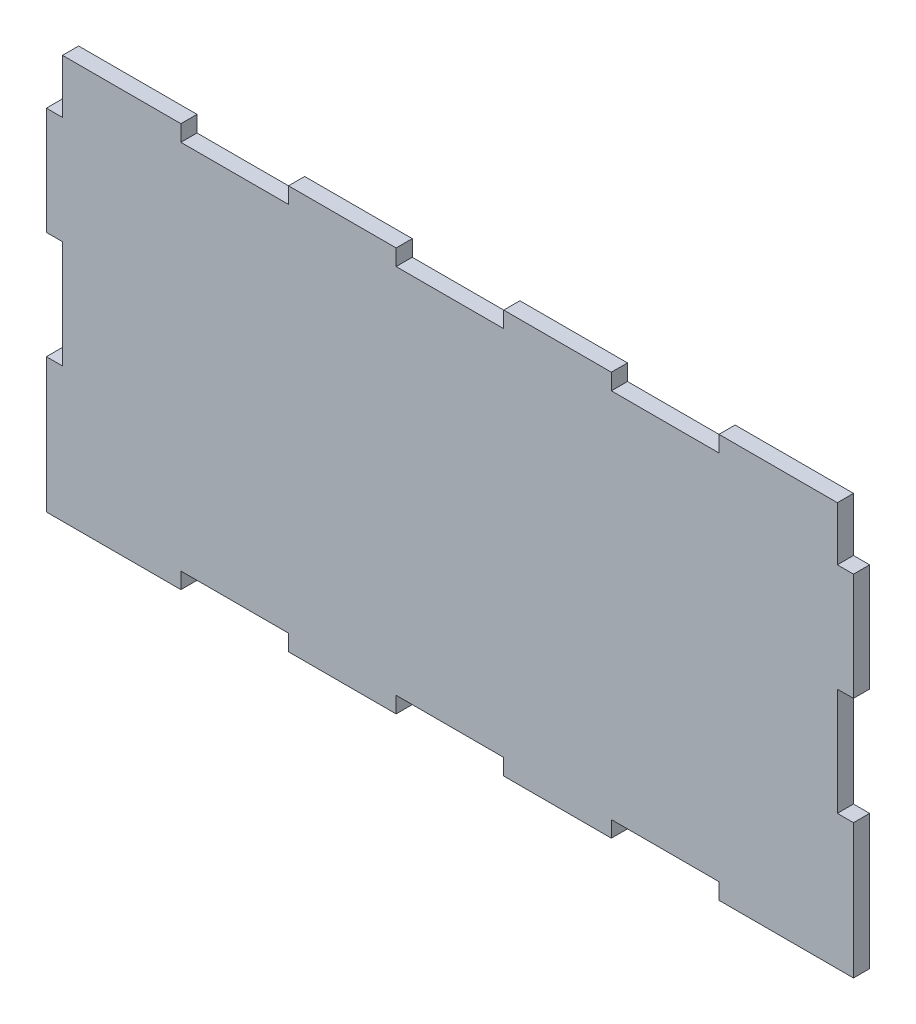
ISO-10303-21;
HEADER;
FILE_DESCRIPTION(('STEP AP214'),'2;1');
FILE_NAME('part.step','',(''),(''),'','','');
FILE_SCHEMA(('AUTOMOTIVE_DESIGN { 1 0 10303 214 1 1 1 1 }'));
ENDSEC;
DATA;
#1=APPLICATION_CONTEXT('core data for automotive mechanical design processes');
#2=APPLICATION_PROTOCOL_DEFINITION('international standard','automotive_design',2000,#1);
#3=PRODUCT_CONTEXT('',#1,'mechanical');
#4=PRODUCT('Part','Part','',(#3));
#5=PRODUCT_RELATED_PRODUCT_CATEGORY('part','',(#4));
#6=PRODUCT_DEFINITION_FORMATION('','',#4);
#7=PRODUCT_DEFINITION_CONTEXT('part definition',#1,'design');
#8=PRODUCT_DEFINITION('design','',#6,#7);
#9=PRODUCT_DEFINITION_SHAPE('','',#8);
#10=(LENGTH_UNIT() NAMED_UNIT(*) SI_UNIT(.MILLI.,.METRE.));
#11=(NAMED_UNIT(*) PLANE_ANGLE_UNIT() SI_UNIT($,.RADIAN.));
#12=(NAMED_UNIT(*) SI_UNIT($,.STERADIAN.) SOLID_ANGLE_UNIT());
#13=UNCERTAINTY_MEASURE_WITH_UNIT(LENGTH_MEASURE(1.E-05),#10,'distance_accuracy_value','');
#14=(GEOMETRIC_REPRESENTATION_CONTEXT(3) GLOBAL_UNCERTAINTY_ASSIGNED_CONTEXT((#13)) GLOBAL_UNIT_ASSIGNED_CONTEXT((#10,
#11,#12)) REPRESENTATION_CONTEXT('',''));
#15=CARTESIAN_POINT('',(0.,0.,0.));
#16=DIRECTION('',(0.,0.,1.));
#17=DIRECTION('',(1.,0.,0.));
#18=AXIS2_PLACEMENT_3D('',#15,#16,#17);
#19=CARTESIAN_POINT('',(0.,0.,12.));
#20=DIRECTION('',(1.,0.,0.));
#21=DIRECTION('',(0.,0.,-1.));
#22=AXIS2_PLACEMENT_3D('',#19,#20,#21);
#23=PLANE('',#22);
#24=DIRECTION('',(0.,-1.,0.));
#25=VECTOR('',#24,1.);
#26=CARTESIAN_POINT('',(0.,0.,0.));
#27=LINE('',#26,#25);
#28=CARTESIAN_POINT('',(0.,260.,0.));
#29=VERTEX_POINT('',#28);
#30=CARTESIAN_POINT('',(0.,180.,0.));
#31=VERTEX_POINT('',#30);
#32=EDGE_CURVE('E565',#29,#31,#27,.T.);
#33=ORIENTED_EDGE('',*,*,#32,.T.);
#34=DIRECTION('',(0.,0.,1.));
#35=VECTOR('',#34,1.);
#36=CARTESIAN_POINT('',(0.,180.,0.));
#37=LINE('',#36,#35);
#38=CARTESIAN_POINT('',(0.,180.,12.));
#39=VERTEX_POINT('',#38);
#40=EDGE_CURVE('E395',#31,#39,#37,.T.);
#41=ORIENTED_EDGE('',*,*,#40,.T.);
#42=DIRECTION('',(0.,-1.,0.));
#43=VECTOR('',#42,1.);
#44=CARTESIAN_POINT('',(0.,0.,12.));
#45=LINE('',#44,#43);
#46=CARTESIAN_POINT('',(0.,260.,12.));
#47=VERTEX_POINT('',#46);
#48=EDGE_CURVE('E550',#47,#39,#45,.T.);
#49=ORIENTED_EDGE('',*,*,#48,.F.);
#50=DIRECTION('',(0.,0.,1.));
#51=VECTOR('',#50,1.);
#52=CARTESIAN_POINT('',(0.,260.,0.));
#53=LINE('',#52,#51);
#54=EDGE_CURVE('E477',#29,#47,#53,.T.);
#55=ORIENTED_EDGE('',*,*,#54,.F.);
#56=EDGE_LOOP('',(#33,#41,#49,#55));
#57=FACE_BOUND('',#56,.T.);
#58=ADVANCED_FACE('F44',(#57),#23,.F.);
#59=CARTESIAN_POINT('',(0.,0.,12.));
#60=DIRECTION('',(0.,1.,0.));
#61=DIRECTION('',(0.,0.,1.));
#62=AXIS2_PLACEMENT_3D('',#59,#60,#61);
#63=PLANE('',#62);
#64=DIRECTION('',(1.,0.,0.));
#65=VECTOR('',#64,1.);
#66=CARTESIAN_POINT('',(0.,0.,0.));
#67=LINE('',#66,#65);
#68=CARTESIAN_POINT('',(340.,0.,0.));
#69=VERTEX_POINT('',#68);
#70=CARTESIAN_POINT('',(420.,0.,0.));
#71=VERTEX_POINT('',#70);
#72=EDGE_CURVE('E648',#69,#71,#67,.T.);
#73=ORIENTED_EDGE('',*,*,#72,.T.);
#74=DIRECTION('',(0.,0.,1.));
#75=VECTOR('',#74,1.);
#76=CARTESIAN_POINT('',(420.,0.,0.));
#77=LINE('',#76,#75);
#78=CARTESIAN_POINT('',(420.,0.,12.));
#79=VERTEX_POINT('',#78);
#80=EDGE_CURVE('E451',#71,#79,#77,.T.);
#81=ORIENTED_EDGE('',*,*,#80,.T.);
#82=DIRECTION('',(1.,0.,0.));
#83=VECTOR('',#82,1.);
#84=CARTESIAN_POINT('',(0.,0.,12.));
#85=LINE('',#84,#83);
#86=CARTESIAN_POINT('',(340.,0.,12.));
#87=VERTEX_POINT('',#86);
#88=EDGE_CURVE('E617',#87,#79,#85,.T.);
#89=ORIENTED_EDGE('',*,*,#88,.F.);
#90=DIRECTION('',(0.,0.,1.));
#91=VECTOR('',#90,1.);
#92=CARTESIAN_POINT('',(340.,0.,0.));
#93=LINE('',#92,#91);
#94=EDGE_CURVE('E427',#69,#87,#93,.T.);
#95=ORIENTED_EDGE('',*,*,#94,.F.);
#96=EDGE_LOOP('',(#73,#81,#89,#95));
#97=FACE_BOUND('',#96,.T.);
#98=ADVANCED_FACE('F647',(#97),#63,.F.);
#99=CARTESIAN_POINT('',(180.,0.,0.));
#100=VERTEX_POINT('',#99);
#101=CARTESIAN_POINT('',(260.,0.,0.));
#102=VERTEX_POINT('',#101);
#103=EDGE_CURVE('E570',#100,#102,#67,.T.);
#104=ORIENTED_EDGE('',*,*,#103,.T.);
#105=DIRECTION('',(0.,0.,1.));
#106=VECTOR('',#105,1.);
#107=CARTESIAN_POINT('',(260.,0.,0.));
#108=LINE('',#107,#106);
#109=CARTESIAN_POINT('',(260.,0.,12.));
#110=VERTEX_POINT('',#109);
#111=EDGE_CURVE('E423',#102,#110,#108,.T.);
#112=ORIENTED_EDGE('',*,*,#111,.T.);
#113=CARTESIAN_POINT('',(180.,0.,12.));
#114=VERTEX_POINT('',#113);
#115=EDGE_CURVE('E556',#114,#110,#85,.T.);
#116=ORIENTED_EDGE('',*,*,#115,.F.);
#117=DIRECTION('',(0.,0.,1.));
#118=VECTOR('',#117,1.);
#119=CARTESIAN_POINT('',(180.,0.,0.));
#120=LINE('',#119,#118);
#121=EDGE_CURVE('E538',#100,#114,#120,.T.);
#122=ORIENTED_EDGE('',*,*,#121,.F.);
#123=EDGE_LOOP('',(#104,#112,#116,#122));
#124=FACE_BOUND('',#123,.T.);
#125=ADVANCED_FACE('F633',(#124),#63,.F.);
#126=CARTESIAN_POINT('',(0.,0.,0.));
#127=VERTEX_POINT('',#126);
#128=CARTESIAN_POINT('',(100.,0.,0.));
#129=VERTEX_POINT('',#128);
#130=EDGE_CURVE('E566',#127,#129,#67,.T.);
#131=ORIENTED_EDGE('',*,*,#130,.T.);
#132=DIRECTION('',(0.,0.,1.));
#133=VECTOR('',#132,1.);
#134=CARTESIAN_POINT('',(100.,0.,0.));
#135=LINE('',#134,#133);
#136=CARTESIAN_POINT('',(100.,0.,12.));
#137=VERTEX_POINT('',#136);
#138=EDGE_CURVE('E526',#129,#137,#135,.T.);
#139=ORIENTED_EDGE('',*,*,#138,.T.);
#140=CARTESIAN_POINT('',(0.,0.,12.));
#141=VERTEX_POINT('',#140);
#142=EDGE_CURVE('E552',#141,#137,#85,.T.);
#143=ORIENTED_EDGE('',*,*,#142,.F.);
#144=DIRECTION('',(0.,0.,-1.));
#145=VECTOR('',#144,1.);
#146=CARTESIAN_POINT('',(0.,0.,12.));
#147=LINE('',#146,#145);
#148=EDGE_CURVE('E52',#141,#127,#147,.T.);
#149=ORIENTED_EDGE('',*,*,#148,.T.);
#150=EDGE_LOOP('',(#131,#139,#143,#149));
#151=FACE_BOUND('',#150,.T.);
#152=ADVANCED_FACE('F585',(#151),#63,.F.);
#153=CARTESIAN_POINT('',(600.,0.,12.));
#154=DIRECTION('',(-1.,0.,0.));
#155=DIRECTION('',(0.,0.,1.));
#156=AXIS2_PLACEMENT_3D('',#153,#154,#155);
#157=PLANE('',#156);
#158=DIRECTION('',(0.,1.,0.));
#159=VECTOR('',#158,1.);
#160=CARTESIAN_POINT('',(600.,0.,0.));
#161=LINE('',#160,#159);
#162=CARTESIAN_POINT('',(600.,0.,0.));
#163=VERTEX_POINT('',#162);
#164=CARTESIAN_POINT('',(600.,100.,0.));
#165=VERTEX_POINT('',#164);
#166=EDGE_CURVE('E572',#163,#165,#161,.T.);
#167=ORIENTED_EDGE('',*,*,#166,.T.);
#168=DIRECTION('',(0.,0.,1.));
#169=VECTOR('',#168,1.);
#170=CARTESIAN_POINT('',(600.,100.,0.));
#171=LINE('',#170,#169);
#172=CARTESIAN_POINT('',(600.,100.,12.));
#173=VERTEX_POINT('',#172);
#174=EDGE_CURVE('E335',#165,#173,#171,.T.);
#175=ORIENTED_EDGE('',*,*,#174,.T.);
#176=DIRECTION('',(0.,1.,0.));
#177=VECTOR('',#176,1.);
#178=CARTESIAN_POINT('',(600.,0.,12.));
#179=LINE('',#178,#177);
#180=CARTESIAN_POINT('',(600.,0.,12.));
#181=VERTEX_POINT('',#180);
#182=EDGE_CURVE('E324',#181,#173,#179,.T.);
#183=ORIENTED_EDGE('',*,*,#182,.F.);
#184=DIRECTION('',(0.,0.,-1.));
#185=VECTOR('',#184,1.);
#186=CARTESIAN_POINT('',(600.,0.,12.));
#187=LINE('',#186,#185);
#188=EDGE_CURVE('E579',#181,#163,#187,.T.);
#189=ORIENTED_EDGE('',*,*,#188,.T.);
#190=EDGE_LOOP('',(#167,#175,#183,#189));
#191=FACE_BOUND('',#190,.T.);
#192=ADVANCED_FACE('F664',(#191),#157,.F.);
#193=CARTESIAN_POINT('',(0.,300.,12.));
#194=DIRECTION('',(0.,-1.,0.));
#195=DIRECTION('',(0.,0.,-1.));
#196=AXIS2_PLACEMENT_3D('',#193,#194,#195);
#197=PLANE('',#196);
#198=DIRECTION('',(-1.,0.,0.));
#199=VECTOR('',#198,1.);
#200=CARTESIAN_POINT('',(0.,300.,0.));
#201=LINE('',#200,#199);
#202=CARTESIAN_POINT('',(588.,300.,0.));
#203=VERTEX_POINT('',#202);
#204=CARTESIAN_POINT('',(500.,300.,0.));
#205=VERTEX_POINT('',#204);
#206=EDGE_CURVE('E551',#203,#205,#201,.T.);
#207=ORIENTED_EDGE('',*,*,#206,.T.);
#208=DIRECTION('',(0.,0.,1.));
#209=VECTOR('',#208,1.);
#210=CARTESIAN_POINT('',(500.,300.,0.));
#211=LINE('',#210,#209);
#212=CARTESIAN_POINT('',(500.,300.,12.));
#213=VERTEX_POINT('',#212);
#214=EDGE_CURVE('E382',#205,#213,#211,.T.);
#215=ORIENTED_EDGE('',*,*,#214,.T.);
#216=DIRECTION('',(-1.,0.,0.));
#217=VECTOR('',#216,1.);
#218=CARTESIAN_POINT('',(0.,300.,12.));
#219=LINE('',#218,#217);
#220=CARTESIAN_POINT('',(588.,300.,12.));
#221=VERTEX_POINT('',#220);
#222=EDGE_CURVE('E563',#221,#213,#219,.T.);
#223=ORIENTED_EDGE('',*,*,#222,.F.);
#224=DIRECTION('',(0.,0.,-1.));
#225=VECTOR('',#224,1.);
#226=CARTESIAN_POINT('',(588.,300.,12.));
#227=LINE('',#226,#225);
#228=EDGE_CURVE('E544',#221,#203,#227,.T.);
#229=ORIENTED_EDGE('',*,*,#228,.T.);
#230=EDGE_LOOP('',(#207,#215,#223,#229));
#231=FACE_BOUND('',#230,.T.);
#232=ADVANCED_FACE('F690',(#231),#197,.F.);
#233=CARTESIAN_POINT('',(420.,300.,12.));
#234=VERTEX_POINT('',#233);
#235=CARTESIAN_POINT('',(340.,300.,12.));
#236=VERTEX_POINT('',#235);
#237=EDGE_CURVE('E692',#234,#236,#219,.T.);
#238=ORIENTED_EDGE('',*,*,#237,.F.);
#239=DIRECTION('',(0.,0.,1.));
#240=VECTOR('',#239,1.);
#241=CARTESIAN_POINT('',(420.,300.,0.));
#242=LINE('',#241,#240);
#243=CARTESIAN_POINT('',(420.,300.,0.));
#244=VERTEX_POINT('',#243);
#245=EDGE_CURVE('E375',#244,#234,#242,.T.);
#246=ORIENTED_EDGE('',*,*,#245,.F.);
#247=CARTESIAN_POINT('',(340.,300.,0.));
#248=VERTEX_POINT('',#247);
#249=EDGE_CURVE('E1158',#244,#248,#201,.T.);
#250=ORIENTED_EDGE('',*,*,#249,.T.);
#251=DIRECTION('',(0.,0.,1.));
#252=VECTOR('',#251,1.);
#253=CARTESIAN_POINT('',(340.,300.,0.));
#254=LINE('',#253,#252);
#255=EDGE_CURVE('E359',#248,#236,#254,.T.);
#256=ORIENTED_EDGE('',*,*,#255,.T.);
#257=EDGE_LOOP('',(#238,#246,#250,#256));
#258=FACE_BOUND('',#257,.T.);
#259=ADVANCED_FACE('F745',(#258),#197,.F.);
#260=CARTESIAN_POINT('',(260.,300.,12.));
#261=VERTEX_POINT('',#260);
#262=CARTESIAN_POINT('',(180.,300.,12.));
#263=VERTEX_POINT('',#262);
#264=EDGE_CURVE('E562',#261,#263,#219,.T.);
#265=ORIENTED_EDGE('',*,*,#264,.F.);
#266=DIRECTION('',(0.,0.,1.));
#267=VECTOR('',#266,1.);
#268=CARTESIAN_POINT('',(260.,300.,0.));
#269=LINE('',#268,#267);
#270=CARTESIAN_POINT('',(260.,300.,0.));
#271=VERTEX_POINT('',#270);
#272=EDGE_CURVE('E401',#271,#261,#269,.T.);
#273=ORIENTED_EDGE('',*,*,#272,.F.);
#274=CARTESIAN_POINT('',(180.,300.,0.));
#275=VERTEX_POINT('',#274);
#276=EDGE_CURVE('E578',#271,#275,#201,.T.);
#277=ORIENTED_EDGE('',*,*,#276,.T.);
#278=DIRECTION('',(0.,0.,1.));
#279=VECTOR('',#278,1.);
#280=CARTESIAN_POINT('',(180.,300.,0.));
#281=LINE('',#280,#279);
#282=EDGE_CURVE('E346',#275,#263,#281,.T.);
#283=ORIENTED_EDGE('',*,*,#282,.T.);
#284=EDGE_LOOP('',(#265,#273,#277,#283));
#285=FACE_BOUND('',#284,.T.);
#286=ADVANCED_FACE('F705',(#285),#197,.F.);
#287=CARTESIAN_POINT('',(0.,100.,12.));
#288=VERTEX_POINT('',#287);
#289=EDGE_CURVE('E548',#288,#141,#45,.T.);
#290=ORIENTED_EDGE('',*,*,#289,.F.);
#291=DIRECTION('',(0.,0.,1.));
#292=VECTOR('',#291,1.);
#293=CARTESIAN_POINT('',(0.,100.,0.));
#294=LINE('',#293,#292);
#295=CARTESIAN_POINT('',(0.,100.,0.));
#296=VERTEX_POINT('',#295);
#297=EDGE_CURVE('E492',#296,#288,#294,.T.);
#298=ORIENTED_EDGE('',*,*,#297,.F.);
#299=EDGE_CURVE('E547',#296,#127,#27,.T.);
#300=ORIENTED_EDGE('',*,*,#299,.T.);
#301=ORIENTED_EDGE('',*,*,#148,.F.);
#302=EDGE_LOOP('',(#290,#298,#300,#301));
#303=FACE_BOUND('',#302,.T.);
#304=ADVANCED_FACE('F46',(#303),#23,.F.);
#305=CARTESIAN_POINT('',(500.,0.,12.));
#306=VERTEX_POINT('',#305);
#307=EDGE_CURVE('E557',#306,#181,#85,.T.);
#308=ORIENTED_EDGE('',*,*,#307,.F.);
#309=DIRECTION('',(0.,0.,1.));
#310=VECTOR('',#309,1.);
#311=CARTESIAN_POINT('',(500.,0.,0.));
#312=LINE('',#311,#310);
#313=CARTESIAN_POINT('',(500.,0.,0.));
#314=VERTEX_POINT('',#313);
#315=EDGE_CURVE('E455',#314,#306,#312,.T.);
#316=ORIENTED_EDGE('',*,*,#315,.F.);
#317=EDGE_CURVE('E571',#314,#163,#67,.T.);
#318=ORIENTED_EDGE('',*,*,#317,.T.);
#319=ORIENTED_EDGE('',*,*,#188,.F.);
#320=EDGE_LOOP('',(#308,#316,#318,#319));
#321=FACE_BOUND('',#320,.T.);
#322=ADVANCED_FACE('F661',(#321),#63,.F.);
#323=CARTESIAN_POINT('',(600.,180.,0.));
#324=VERTEX_POINT('',#323);
#325=CARTESIAN_POINT('',(600.,260.,0.));
#326=VERTEX_POINT('',#325);
#327=EDGE_CURVE('E569',#324,#326,#161,.T.);
#328=ORIENTED_EDGE('',*,*,#327,.T.);
#329=DIRECTION('',(0.,0.,1.));
#330=VECTOR('',#329,1.);
#331=CARTESIAN_POINT('',(600.,260.,0.));
#332=LINE('',#331,#330);
#333=CARTESIAN_POINT('',(600.,260.,12.));
#334=VERTEX_POINT('',#333);
#335=EDGE_CURVE('E328',#326,#334,#332,.T.);
#336=ORIENTED_EDGE('',*,*,#335,.T.);
#337=CARTESIAN_POINT('',(600.,180.,12.));
#338=VERTEX_POINT('',#337);
#339=EDGE_CURVE('E555',#338,#334,#179,.T.);
#340=ORIENTED_EDGE('',*,*,#339,.F.);
#341=DIRECTION('',(0.,0.,1.));
#342=VECTOR('',#341,1.);
#343=CARTESIAN_POINT('',(600.,180.,0.));
#344=LINE('',#343,#342);
#345=EDGE_CURVE('E665',#324,#338,#344,.T.);
#346=ORIENTED_EDGE('',*,*,#345,.F.);
#347=EDGE_LOOP('',(#328,#336,#340,#346));
#348=FACE_BOUND('',#347,.T.);
#349=ADVANCED_FACE('F678',(#348),#157,.F.);
#350=CARTESIAN_POINT('',(100.,300.,12.));
#351=VERTEX_POINT('',#350);
#352=CARTESIAN_POINT('',(12.,300.,12.));
#353=VERTEX_POINT('',#352);
#354=EDGE_CURVE('E559',#351,#353,#219,.T.);
#355=ORIENTED_EDGE('',*,*,#354,.F.);
#356=DIRECTION('',(0.,0.,1.));
#357=VECTOR('',#356,1.);
#358=CARTESIAN_POINT('',(100.,300.,0.));
#359=LINE('',#358,#357);
#360=CARTESIAN_POINT('',(100.,300.,0.));
#361=VERTEX_POINT('',#360);
#362=EDGE_CURVE('E339',#361,#351,#359,.T.);
#363=ORIENTED_EDGE('',*,*,#362,.F.);
#364=CARTESIAN_POINT('',(12.,300.,0.));
#365=VERTEX_POINT('',#364);
#366=EDGE_CURVE('E575',#361,#365,#201,.T.);
#367=ORIENTED_EDGE('',*,*,#366,.T.);
#368=DIRECTION('',(0.,0.,1.));
#369=VECTOR('',#368,1.);
#370=CARTESIAN_POINT('',(12.,300.,12.));
#371=LINE('',#370,#369);
#372=EDGE_CURVE('E535',#365,#353,#371,.T.);
#373=ORIENTED_EDGE('',*,*,#372,.T.);
#374=EDGE_LOOP('',(#355,#363,#367,#373));
#375=FACE_BOUND('',#374,.T.);
#376=ADVANCED_FACE('F721',(#375),#197,.F.);
#377=CARTESIAN_POINT('',(0.,0.,12.));
#378=DIRECTION('',(0.,0.,-1.));
#379=DIRECTION('',(-1.,0.,0.));
#380=AXIS2_PLACEMENT_3D('',#377,#378,#379);
#381=PLANE('',#380);
#382=ORIENTED_EDGE('',*,*,#222,.T.);
#383=DIRECTION('',(0.,1.,0.));
#384=VECTOR('',#383,1.);
#385=CARTESIAN_POINT('',(500.,300.,12.));
#386=LINE('',#385,#384);
#387=CARTESIAN_POINT('',(500.,288.,12.));
#388=VERTEX_POINT('',#387);
#389=EDGE_CURVE('E386',#388,#213,#386,.T.);
#390=ORIENTED_EDGE('',*,*,#389,.F.);
#391=DIRECTION('',(1.,0.,0.));
#392=VECTOR('',#391,1.);
#393=CARTESIAN_POINT('',(420.,288.,12.));
#394=LINE('',#393,#392);
#395=CARTESIAN_POINT('',(420.,288.,12.));
#396=VERTEX_POINT('',#395);
#397=EDGE_CURVE('E388',#396,#388,#394,.T.);
#398=ORIENTED_EDGE('',*,*,#397,.F.);
#399=DIRECTION('',(0.,-1.,0.));
#400=VECTOR('',#399,1.);
#401=CARTESIAN_POINT('',(420.,300.,12.));
#402=LINE('',#401,#400);
#403=EDGE_CURVE('E392',#234,#396,#402,.T.);
#404=ORIENTED_EDGE('',*,*,#403,.F.);
#405=ORIENTED_EDGE('',*,*,#237,.T.);
#406=DIRECTION('',(0.,1.,0.));
#407=VECTOR('',#406,1.);
#408=CARTESIAN_POINT('',(340.,300.,12.));
#409=LINE('',#408,#407);
#410=CARTESIAN_POINT('',(340.,288.,12.));
#411=VERTEX_POINT('',#410);
#412=EDGE_CURVE('E410',#411,#236,#409,.T.);
#413=ORIENTED_EDGE('',*,*,#412,.F.);
#414=DIRECTION('',(1.,0.,0.));
#415=VECTOR('',#414,1.);
#416=CARTESIAN_POINT('',(260.,288.,12.));
#417=LINE('',#416,#415);
#418=CARTESIAN_POINT('',(260.,288.,12.));
#419=VERTEX_POINT('',#418);
#420=EDGE_CURVE('E412',#419,#411,#417,.T.);
#421=ORIENTED_EDGE('',*,*,#420,.F.);
#422=DIRECTION('',(0.,-1.,0.));
#423=VECTOR('',#422,1.);
#424=CARTESIAN_POINT('',(260.,300.,12.));
#425=LINE('',#424,#423);
#426=EDGE_CURVE('E385',#261,#419,#425,.T.);
#427=ORIENTED_EDGE('',*,*,#426,.F.);
#428=ORIENTED_EDGE('',*,*,#264,.T.);
#429=DIRECTION('',(0.,1.,0.));
#430=VECTOR('',#429,1.);
#431=CARTESIAN_POINT('',(180.,300.,12.));
#432=LINE('',#431,#430);
#433=CARTESIAN_POINT('',(180.,288.,12.));
#434=VERTEX_POINT('',#433);
#435=EDGE_CURVE('E350',#434,#263,#432,.T.);
#436=ORIENTED_EDGE('',*,*,#435,.F.);
#437=DIRECTION('',(1.,0.,0.));
#438=VECTOR('',#437,1.);
#439=CARTESIAN_POINT('',(100.,288.,12.));
#440=LINE('',#439,#438);
#441=CARTESIAN_POINT('',(100.,288.,12.));
#442=VERTEX_POINT('',#441);
#443=EDGE_CURVE('E352',#442,#434,#440,.T.);
#444=ORIENTED_EDGE('',*,*,#443,.F.);
#445=DIRECTION('',(0.,-1.,0.));
#446=VECTOR('',#445,1.);
#447=CARTESIAN_POINT('',(100.,300.,12.));
#448=LINE('',#447,#446);
#449=EDGE_CURVE('E356',#351,#442,#448,.T.);
#450=ORIENTED_EDGE('',*,*,#449,.F.);
#451=ORIENTED_EDGE('',*,*,#354,.T.);
#452=DIRECTION('',(0.,1.,0.));
#453=VECTOR('',#452,1.);
#454=CARTESIAN_POINT('',(12.,260.,12.));
#455=LINE('',#454,#453);
#456=CARTESIAN_POINT('',(12.,260.,12.));
#457=VERTEX_POINT('',#456);
#458=EDGE_CURVE('E483',#457,#353,#455,.T.);
#459=ORIENTED_EDGE('',*,*,#458,.F.);
#460=DIRECTION('',(1.,0.,0.));
#461=VECTOR('',#460,1.);
#462=CARTESIAN_POINT('',(0.,260.,12.));
#463=LINE('',#462,#461);
#464=EDGE_CURVE('E461',#47,#457,#463,.T.);
#465=ORIENTED_EDGE('',*,*,#464,.F.);
#466=ORIENTED_EDGE('',*,*,#48,.T.);
#467=DIRECTION('',(-1.,0.,0.));
#468=VECTOR('',#467,1.);
#469=CARTESIAN_POINT('',(0.,180.,12.));
#470=LINE('',#469,#468);
#471=CARTESIAN_POINT('',(12.,180.,12.));
#472=VERTEX_POINT('',#471);
#473=EDGE_CURVE('E501',#472,#39,#470,.T.);
#474=ORIENTED_EDGE('',*,*,#473,.F.);
#475=DIRECTION('',(0.,1.,0.));
#476=VECTOR('',#475,1.);
#477=CARTESIAN_POINT('',(12.,100.,12.));
#478=LINE('',#477,#476);
#479=CARTESIAN_POINT('',(12.,100.,12.));
#480=VERTEX_POINT('',#479);
#481=EDGE_CURVE('E503',#480,#472,#478,.T.);
#482=ORIENTED_EDGE('',*,*,#481,.F.);
#483=DIRECTION('',(1.,0.,0.));
#484=VECTOR('',#483,1.);
#485=CARTESIAN_POINT('',(0.,100.,12.));
#486=LINE('',#485,#484);
#487=EDGE_CURVE('E482',#288,#480,#486,.T.);
#488=ORIENTED_EDGE('',*,*,#487,.F.);
#489=ORIENTED_EDGE('',*,*,#289,.T.);
#490=ORIENTED_EDGE('',*,*,#142,.T.);
#491=DIRECTION('',(0.,-1.,0.));
#492=VECTOR('',#491,1.);
#493=CARTESIAN_POINT('',(100.,0.,12.));
#494=LINE('',#493,#492);
#495=CARTESIAN_POINT('',(100.,12.,12.));
#496=VERTEX_POINT('',#495);
#497=EDGE_CURVE('E443',#496,#137,#494,.T.);
#498=ORIENTED_EDGE('',*,*,#497,.F.);
#499=DIRECTION('',(-1.,0.,0.));
#500=VECTOR('',#499,1.);
#501=CARTESIAN_POINT('',(100.,12.,12.));
#502=LINE('',#501,#500);
#503=CARTESIAN_POINT('',(180.,12.,12.));
#504=VERTEX_POINT('',#503);
#505=EDGE_CURVE('E520',#504,#496,#502,.T.);
#506=ORIENTED_EDGE('',*,*,#505,.F.);
#507=DIRECTION('',(0.,1.,0.));
#508=VECTOR('',#507,1.);
#509=CARTESIAN_POINT('',(180.,0.,12.));
#510=LINE('',#509,#508);
#511=EDGE_CURVE('E528',#114,#504,#510,.T.);
#512=ORIENTED_EDGE('',*,*,#511,.F.);
#513=ORIENTED_EDGE('',*,*,#115,.T.);
#514=DIRECTION('',(0.,-1.,0.));
#515=VECTOR('',#514,1.);
#516=CARTESIAN_POINT('',(260.,0.,12.));
#517=LINE('',#516,#515);
#518=CARTESIAN_POINT('',(260.,12.,12.));
#519=VERTEX_POINT('',#518);
#520=EDGE_CURVE('E441',#519,#110,#517,.T.);
#521=ORIENTED_EDGE('',*,*,#520,.F.);
#522=DIRECTION('',(-1.,0.,0.));
#523=VECTOR('',#522,1.);
#524=CARTESIAN_POINT('',(260.,12.,12.));
#525=LINE('',#524,#523);
#526=CARTESIAN_POINT('',(340.,12.,12.));
#527=VERTEX_POINT('',#526);
#528=EDGE_CURVE('E434',#527,#519,#525,.T.);
#529=ORIENTED_EDGE('',*,*,#528,.F.);
#530=DIRECTION('',(0.,1.,0.));
#531=VECTOR('',#530,1.);
#532=CARTESIAN_POINT('',(340.,0.,12.));
#533=LINE('',#532,#531);
#534=EDGE_CURVE('E437',#87,#527,#533,.T.);
#535=ORIENTED_EDGE('',*,*,#534,.F.);
#536=ORIENTED_EDGE('',*,*,#88,.T.);
#537=DIRECTION('',(0.,-1.,0.));
#538=VECTOR('',#537,1.);
#539=CARTESIAN_POINT('',(420.,0.,12.));
#540=LINE('',#539,#538);
#541=CARTESIAN_POINT('',(420.,12.,12.));
#542=VERTEX_POINT('',#541);
#543=EDGE_CURVE('E433',#542,#79,#540,.T.);
#544=ORIENTED_EDGE('',*,*,#543,.F.);
#545=DIRECTION('',(-1.,0.,0.));
#546=VECTOR('',#545,1.);
#547=CARTESIAN_POINT('',(420.,12.,12.));
#548=LINE('',#547,#546);
#549=CARTESIAN_POINT('',(500.,12.,12.));
#550=VERTEX_POINT('',#549);
#551=EDGE_CURVE('E462',#550,#542,#548,.T.);
#552=ORIENTED_EDGE('',*,*,#551,.F.);
#553=DIRECTION('',(0.,1.,0.));
#554=VECTOR('',#553,1.);
#555=CARTESIAN_POINT('',(500.,0.,12.));
#556=LINE('',#555,#554);
#557=EDGE_CURVE('E465',#306,#550,#556,.T.);
#558=ORIENTED_EDGE('',*,*,#557,.F.);
#559=ORIENTED_EDGE('',*,*,#307,.T.);
#560=ORIENTED_EDGE('',*,*,#182,.T.);
#561=DIRECTION('',(1.,0.,0.));
#562=VECTOR('',#561,1.);
#563=CARTESIAN_POINT('',(600.,100.,12.));
#564=LINE('',#563,#562);
#565=CARTESIAN_POINT('',(588.,100.,12.));
#566=VERTEX_POINT('',#565);
#567=EDGE_CURVE('E303',#566,#173,#564,.T.);
#568=ORIENTED_EDGE('',*,*,#567,.F.);
#569=DIRECTION('',(0.,-1.,0.));
#570=VECTOR('',#569,1.);
#571=CARTESIAN_POINT('',(588.,100.,12.));
#572=LINE('',#571,#570);
#573=CARTESIAN_POINT('',(588.,180.,12.));
#574=VERTEX_POINT('',#573);
#575=EDGE_CURVE('E312',#574,#566,#572,.T.);
#576=ORIENTED_EDGE('',*,*,#575,.F.);
#577=DIRECTION('',(-1.,0.,0.));
#578=VECTOR('',#577,1.);
#579=CARTESIAN_POINT('',(600.,180.,12.));
#580=LINE('',#579,#578);
#581=EDGE_CURVE('E318',#338,#574,#580,.T.);
#582=ORIENTED_EDGE('',*,*,#581,.F.);
#583=ORIENTED_EDGE('',*,*,#339,.T.);
#584=DIRECTION('',(1.,0.,0.));
#585=VECTOR('',#584,1.);
#586=CARTESIAN_POINT('',(600.,260.,12.));
#587=LINE('',#586,#585);
#588=CARTESIAN_POINT('',(588.,260.,12.));
#589=VERTEX_POINT('',#588);
#590=EDGE_CURVE('E349',#589,#334,#587,.T.);
#591=ORIENTED_EDGE('',*,*,#590,.F.);
#592=DIRECTION('',(0.,-1.,0.));
#593=VECTOR('',#592,1.);
#594=CARTESIAN_POINT('',(588.,260.,12.));
#595=LINE('',#594,#593);
#596=EDGE_CURVE('E370',#221,#589,#595,.T.);
#597=ORIENTED_EDGE('',*,*,#596,.F.);
#598=EDGE_LOOP('',(#382,#390,#398,#404,#405,#413,#421,#427,#428,#436,#444,#450,#451,#459,#465,
#466,#474,#482,#488,#489,#490,#498,#506,#512,#513,#521,#529,#535,#536,#544,#552,#558,#559,#560,
#568,#576,#582,#583,#591,#597));
#599=FACE_BOUND('',#598,.T.);
#600=ADVANCED_FACE('F322',(#599),#381,.F.);
#601=CARTESIAN_POINT('',(0.,0.,0.));
#602=DIRECTION('',(0.,0.,-1.));
#603=DIRECTION('',(-1.,0.,0.));
#604=AXIS2_PLACEMENT_3D('',#601,#602,#603);
#605=PLANE('',#604);
#606=DIRECTION('',(0.,1.,0.));
#607=VECTOR('',#606,1.);
#608=CARTESIAN_POINT('',(500.,300.,0.));
#609=LINE('',#608,#607);
#610=CARTESIAN_POINT('',(500.,288.,0.));
#611=VERTEX_POINT('',#610);
#612=EDGE_CURVE('E377',#611,#205,#609,.T.);
#613=ORIENTED_EDGE('',*,*,#612,.T.);
#614=ORIENTED_EDGE('',*,*,#206,.F.);
#615=DIRECTION('',(0.,1.,0.));
#616=VECTOR('',#615,1.);
#617=CARTESIAN_POINT('',(588.,0.,0.));
#618=LINE('',#617,#616);
#619=CARTESIAN_POINT('',(588.,260.,0.));
#620=VERTEX_POINT('',#619);
#621=EDGE_CURVE('E12',#620,#203,#618,.T.);
#622=ORIENTED_EDGE('',*,*,#621,.F.);
#623=DIRECTION('',(1.,0.,0.));
#624=VECTOR('',#623,1.);
#625=CARTESIAN_POINT('',(600.,260.,0.));
#626=LINE('',#625,#624);
#627=EDGE_CURVE('E368',#620,#326,#626,.T.);
#628=ORIENTED_EDGE('',*,*,#627,.T.);
#629=ORIENTED_EDGE('',*,*,#327,.F.);
#630=DIRECTION('',(-1.,0.,0.));
#631=VECTOR('',#630,1.);
#632=CARTESIAN_POINT('',(600.,180.,0.));
#633=LINE('',#632,#631);
#634=CARTESIAN_POINT('',(588.,180.,0.));
#635=VERTEX_POINT('',#634);
#636=EDGE_CURVE('E334',#324,#635,#633,.T.);
#637=ORIENTED_EDGE('',*,*,#636,.T.);
#638=DIRECTION('',(0.,-1.,0.));
#639=VECTOR('',#638,1.);
#640=CARTESIAN_POINT('',(588.,100.,0.));
#641=LINE('',#640,#639);
#642=CARTESIAN_POINT('',(588.,100.,0.));
#643=VERTEX_POINT('',#642);
#644=EDGE_CURVE('E332',#635,#643,#641,.T.);
#645=ORIENTED_EDGE('',*,*,#644,.T.);
#646=DIRECTION('',(1.,0.,0.));
#647=VECTOR('',#646,1.);
#648=CARTESIAN_POINT('',(600.,100.,0.));
#649=LINE('',#648,#647);
#650=EDGE_CURVE('E306',#643,#165,#649,.T.);
#651=ORIENTED_EDGE('',*,*,#650,.T.);
#652=ORIENTED_EDGE('',*,*,#166,.F.);
#653=ORIENTED_EDGE('',*,*,#317,.F.);
#654=DIRECTION('',(0.,1.,0.));
#655=VECTOR('',#654,1.);
#656=CARTESIAN_POINT('',(500.,0.,0.));
#657=LINE('',#656,#655);
#658=CARTESIAN_POINT('',(500.,12.,0.));
#659=VERTEX_POINT('',#658);
#660=EDGE_CURVE('E472',#314,#659,#657,.T.);
#661=ORIENTED_EDGE('',*,*,#660,.T.);
#662=DIRECTION('',(-1.,0.,0.));
#663=VECTOR('',#662,1.);
#664=CARTESIAN_POINT('',(420.,12.,0.));
#665=LINE('',#664,#663);
#666=CARTESIAN_POINT('',(420.,12.,0.));
#667=VERTEX_POINT('',#666);
#668=EDGE_CURVE('E454',#659,#667,#665,.T.);
#669=ORIENTED_EDGE('',*,*,#668,.T.);
#670=DIRECTION('',(0.,-1.,0.));
#671=VECTOR('',#670,1.);
#672=CARTESIAN_POINT('',(420.,0.,0.));
#673=LINE('',#672,#671);
#674=EDGE_CURVE('E466',#667,#71,#673,.T.);
#675=ORIENTED_EDGE('',*,*,#674,.T.);
#676=ORIENTED_EDGE('',*,*,#72,.F.);
#677=DIRECTION('',(0.,1.,0.));
#678=VECTOR('',#677,1.);
#679=CARTESIAN_POINT('',(340.,0.,0.));
#680=LINE('',#679,#678);
#681=CARTESIAN_POINT('',(340.,12.,0.));
#682=VERTEX_POINT('',#681);
#683=EDGE_CURVE('E446',#69,#682,#680,.T.);
#684=ORIENTED_EDGE('',*,*,#683,.T.);
#685=DIRECTION('',(-1.,0.,0.));
#686=VECTOR('',#685,1.);
#687=CARTESIAN_POINT('',(260.,12.,0.));
#688=LINE('',#687,#686);
#689=CARTESIAN_POINT('',(260.,12.,0.));
#690=VERTEX_POINT('',#689);
#691=EDGE_CURVE('E426',#682,#690,#688,.T.);
#692=ORIENTED_EDGE('',*,*,#691,.T.);
#693=DIRECTION('',(0.,-1.,0.));
#694=VECTOR('',#693,1.);
#695=CARTESIAN_POINT('',(260.,0.,0.));
#696=LINE('',#695,#694);
#697=EDGE_CURVE('E438',#690,#102,#696,.T.);
#698=ORIENTED_EDGE('',*,*,#697,.T.);
#699=ORIENTED_EDGE('',*,*,#103,.F.);
#700=DIRECTION('',(0.,1.,0.));
#701=VECTOR('',#700,1.);
#702=CARTESIAN_POINT('',(180.,0.,0.));
#703=LINE('',#702,#701);
#704=CARTESIAN_POINT('',(180.,12.,0.));
#705=VERTEX_POINT('',#704);
#706=EDGE_CURVE('E519',#100,#705,#703,.T.);
#707=ORIENTED_EDGE('',*,*,#706,.T.);
#708=DIRECTION('',(-1.,0.,0.));
#709=VECTOR('',#708,1.);
#710=CARTESIAN_POINT('',(100.,12.,0.));
#711=LINE('',#710,#709);
#712=CARTESIAN_POINT('',(100.,12.,0.));
#713=VERTEX_POINT('',#712);
#714=EDGE_CURVE('E523',#705,#713,#711,.T.);
#715=ORIENTED_EDGE('',*,*,#714,.T.);
#716=DIRECTION('',(0.,-1.,0.));
#717=VECTOR('',#716,1.);
#718=CARTESIAN_POINT('',(100.,0.,0.));
#719=LINE('',#718,#717);
#720=EDGE_CURVE('E516',#713,#129,#719,.T.);
#721=ORIENTED_EDGE('',*,*,#720,.T.);
#722=ORIENTED_EDGE('',*,*,#130,.F.);
#723=ORIENTED_EDGE('',*,*,#299,.F.);
#724=DIRECTION('',(1.,0.,0.));
#725=VECTOR('',#724,1.);
#726=CARTESIAN_POINT('',(0.,100.,0.));
#727=LINE('',#726,#725);
#728=CARTESIAN_POINT('',(12.,100.,0.));
#729=VERTEX_POINT('',#728);
#730=EDGE_CURVE('E504',#296,#729,#727,.T.);
#731=ORIENTED_EDGE('',*,*,#730,.T.);
#732=DIRECTION('',(0.,1.,0.));
#733=VECTOR('',#732,1.);
#734=CARTESIAN_POINT('',(12.,100.,0.));
#735=LINE('',#734,#733);
#736=CARTESIAN_POINT('',(12.,180.,0.));
#737=VERTEX_POINT('',#736);
#738=EDGE_CURVE('E511',#729,#737,#735,.T.);
#739=ORIENTED_EDGE('',*,*,#738,.T.);
#740=DIRECTION('',(-1.,0.,0.));
#741=VECTOR('',#740,1.);
#742=CARTESIAN_POINT('',(0.,180.,0.));
#743=LINE('',#742,#741);
#744=EDGE_CURVE('E494',#737,#31,#743,.T.);
#745=ORIENTED_EDGE('',*,*,#744,.T.);
#746=ORIENTED_EDGE('',*,*,#32,.F.);
#747=DIRECTION('',(1.,0.,0.));
#748=VECTOR('',#747,1.);
#749=CARTESIAN_POINT('',(0.,260.,0.));
#750=LINE('',#749,#748);
#751=CARTESIAN_POINT('',(12.,260.,0.));
#752=VERTEX_POINT('',#751);
#753=EDGE_CURVE('E485',#29,#752,#750,.T.);
#754=ORIENTED_EDGE('',*,*,#753,.T.);
#755=DIRECTION('',(0.,1.,0.));
#756=VECTOR('',#755,1.);
#757=CARTESIAN_POINT('',(12.,260.,0.));
#758=LINE('',#757,#756);
#759=EDGE_CURVE('E479',#752,#365,#758,.T.);
#760=ORIENTED_EDGE('',*,*,#759,.T.);
#761=ORIENTED_EDGE('',*,*,#366,.F.);
#762=DIRECTION('',(0.,-1.,0.));
#763=VECTOR('',#762,1.);
#764=CARTESIAN_POINT('',(100.,300.,0.));
#765=LINE('',#764,#763);
#766=CARTESIAN_POINT('',(100.,288.,0.));
#767=VERTEX_POINT('',#766);
#768=EDGE_CURVE('E353',#361,#767,#765,.T.);
#769=ORIENTED_EDGE('',*,*,#768,.T.);
#770=DIRECTION('',(1.,0.,0.));
#771=VECTOR('',#770,1.);
#772=CARTESIAN_POINT('',(100.,288.,0.));
#773=LINE('',#772,#771);
#774=CARTESIAN_POINT('',(180.,288.,0.));
#775=VERTEX_POINT('',#774);
#776=EDGE_CURVE('E362',#767,#775,#773,.T.);
#777=ORIENTED_EDGE('',*,*,#776,.T.);
#778=DIRECTION('',(0.,1.,0.));
#779=VECTOR('',#778,1.);
#780=CARTESIAN_POINT('',(180.,300.,0.));
#781=LINE('',#780,#779);
#782=EDGE_CURVE('E341',#775,#275,#781,.T.);
#783=ORIENTED_EDGE('',*,*,#782,.T.);
#784=ORIENTED_EDGE('',*,*,#276,.F.);
#785=DIRECTION('',(0.,-1.,0.));
#786=VECTOR('',#785,1.);
#787=CARTESIAN_POINT('',(260.,300.,0.));
#788=LINE('',#787,#786);
#789=CARTESIAN_POINT('',(260.,288.,0.));
#790=VERTEX_POINT('',#789);
#791=EDGE_CURVE('E413',#271,#790,#788,.T.);
#792=ORIENTED_EDGE('',*,*,#791,.T.);
#793=DIRECTION('',(1.,0.,0.));
#794=VECTOR('',#793,1.);
#795=CARTESIAN_POINT('',(260.,288.,0.));
#796=LINE('',#795,#794);
#797=CARTESIAN_POINT('',(340.,288.,0.));
#798=VERTEX_POINT('',#797);
#799=EDGE_CURVE('E67',#790,#798,#796,.T.);
#800=ORIENTED_EDGE('',*,*,#799,.T.);
#801=DIRECTION('',(0.,1.,0.));
#802=VECTOR('',#801,1.);
#803=CARTESIAN_POINT('',(340.,300.,0.));
#804=LINE('',#803,#802);
#805=EDGE_CURVE('E403',#798,#248,#804,.T.);
#806=ORIENTED_EDGE('',*,*,#805,.T.);
#807=ORIENTED_EDGE('',*,*,#249,.F.);
#808=DIRECTION('',(0.,-1.,0.));
#809=VECTOR('',#808,1.);
#810=CARTESIAN_POINT('',(420.,300.,0.));
#811=LINE('',#810,#809);
#812=CARTESIAN_POINT('',(420.,288.,0.));
#813=VERTEX_POINT('',#812);
#814=EDGE_CURVE('E389',#244,#813,#811,.T.);
#815=ORIENTED_EDGE('',*,*,#814,.T.);
#816=DIRECTION('',(1.,0.,0.));
#817=VECTOR('',#816,1.);
#818=CARTESIAN_POINT('',(420.,288.,0.));
#819=LINE('',#818,#817);
#820=EDGE_CURVE('E59',#813,#611,#819,.T.);
#821=ORIENTED_EDGE('',*,*,#820,.T.);
#822=EDGE_LOOP('',(#613,#614,#622,#628,#629,#637,#645,#651,#652,#653,#661,#669,#675,#676,#684,
#692,#698,#699,#707,#715,#721,#722,#723,#731,#739,#745,#746,#754,#760,#761,#769,#777,#783,#784,
#792,#800,#806,#807,#815,#821));
#823=FACE_BOUND('',#822,.T.);
#824=ADVANCED_FACE('F592',(#823),#605,.T.);
#825=CARTESIAN_POINT('',(100.,0.,0.));
#826=DIRECTION('',(-1.,0.,0.));
#827=DIRECTION('',(0.,0.,1.));
#828=AXIS2_PLACEMENT_3D('',#825,#826,#827);
#829=PLANE('',#828);
#830=ORIENTED_EDGE('',*,*,#497,.T.);
#831=ORIENTED_EDGE('',*,*,#138,.F.);
#832=ORIENTED_EDGE('',*,*,#720,.F.);
#833=DIRECTION('',(0.,0.,1.));
#834=VECTOR('',#833,1.);
#835=CARTESIAN_POINT('',(100.,12.,0.));
#836=LINE('',#835,#834);
#837=EDGE_CURVE('E533',#713,#496,#836,.T.);
#838=ORIENTED_EDGE('',*,*,#837,.T.);
#839=EDGE_LOOP('',(#830,#831,#832,#838));
#840=FACE_BOUND('',#839,.T.);
#841=ADVANCED_FACE('F595',(#840),#829,.F.);
#842=CARTESIAN_POINT('',(100.,12.,0.));
#843=DIRECTION('',(0.,1.,0.));
#844=DIRECTION('',(-1.,0.,0.));
#845=AXIS2_PLACEMENT_3D('',#842,#843,#844);
#846=PLANE('',#845);
#847=ORIENTED_EDGE('',*,*,#505,.T.);
#848=ORIENTED_EDGE('',*,*,#837,.F.);
#849=ORIENTED_EDGE('',*,*,#714,.F.);
#850=DIRECTION('',(0.,0.,1.));
#851=VECTOR('',#850,1.);
#852=CARTESIAN_POINT('',(180.,12.,0.));
#853=LINE('',#852,#851);
#854=EDGE_CURVE('E536',#705,#504,#853,.T.);
#855=ORIENTED_EDGE('',*,*,#854,.T.);
#856=EDGE_LOOP('',(#847,#848,#849,#855));
#857=FACE_BOUND('',#856,.T.);
#858=ADVANCED_FACE('F790',(#857),#846,.F.);
#859=CARTESIAN_POINT('',(180.,0.,0.));
#860=DIRECTION('',(1.,0.,0.));
#861=DIRECTION('',(0.,0.,-1.));
#862=AXIS2_PLACEMENT_3D('',#859,#860,#861);
#863=PLANE('',#862);
#864=ORIENTED_EDGE('',*,*,#511,.T.);
#865=ORIENTED_EDGE('',*,*,#854,.F.);
#866=ORIENTED_EDGE('',*,*,#706,.F.);
#867=ORIENTED_EDGE('',*,*,#121,.T.);
#868=EDGE_LOOP('',(#864,#865,#866,#867));
#869=FACE_BOUND('',#868,.T.);
#870=ADVANCED_FACE('F799',(#869),#863,.F.);
#871=CARTESIAN_POINT('',(600.,100.,0.));
#872=DIRECTION('',(0.,-1.,0.));
#873=DIRECTION('',(0.,0.,-1.));
#874=AXIS2_PLACEMENT_3D('',#871,#872,#873);
#875=PLANE('',#874);
#876=ORIENTED_EDGE('',*,*,#567,.T.);
#877=ORIENTED_EDGE('',*,*,#174,.F.);
#878=ORIENTED_EDGE('',*,*,#650,.F.);
#879=DIRECTION('',(0.,0.,1.));
#880=VECTOR('',#879,1.);
#881=CARTESIAN_POINT('',(588.,100.,0.));
#882=LINE('',#881,#880);
#883=EDGE_CURVE('E299',#643,#566,#882,.T.);
#884=ORIENTED_EDGE('',*,*,#883,.T.);
#885=EDGE_LOOP('',(#876,#877,#878,#884));
#886=FACE_BOUND('',#885,.T.);
#887=ADVANCED_FACE('F301',(#886),#875,.F.);
#888=CARTESIAN_POINT('',(588.,100.,0.));
#889=DIRECTION('',(-1.,0.,0.));
#890=DIRECTION('',(0.,0.,1.));
#891=AXIS2_PLACEMENT_3D('',#888,#889,#890);
#892=PLANE('',#891);
#893=ORIENTED_EDGE('',*,*,#575,.T.);
#894=ORIENTED_EDGE('',*,*,#883,.F.);
#895=ORIENTED_EDGE('',*,*,#644,.F.);
#896=DIRECTION('',(0.,0.,1.));
#897=VECTOR('',#896,1.);
#898=CARTESIAN_POINT('',(588.,180.,0.));
#899=LINE('',#898,#897);
#900=EDGE_CURVE('E309',#635,#574,#899,.T.);
#901=ORIENTED_EDGE('',*,*,#900,.T.);
#902=EDGE_LOOP('',(#893,#894,#895,#901));
#903=FACE_BOUND('',#902,.T.);
#904=ADVANCED_FACE('F313',(#903),#892,.F.);
#905=CARTESIAN_POINT('',(600.,180.,0.));
#906=DIRECTION('',(0.,1.,0.));
#907=DIRECTION('',(0.,0.,1.));
#908=AXIS2_PLACEMENT_3D('',#905,#906,#907);
#909=PLANE('',#908);
#910=ORIENTED_EDGE('',*,*,#581,.T.);
#911=ORIENTED_EDGE('',*,*,#900,.F.);
#912=ORIENTED_EDGE('',*,*,#636,.F.);
#913=ORIENTED_EDGE('',*,*,#345,.T.);
#914=EDGE_LOOP('',(#910,#911,#912,#913));
#915=FACE_BOUND('',#914,.T.);
#916=ADVANCED_FACE('F671',(#915),#909,.F.);
#917=CARTESIAN_POINT('',(260.,0.,0.));
#918=DIRECTION('',(-1.,0.,0.));
#919=DIRECTION('',(0.,0.,1.));
#920=AXIS2_PLACEMENT_3D('',#917,#918,#919);
#921=PLANE('',#920);
#922=ORIENTED_EDGE('',*,*,#520,.T.);
#923=ORIENTED_EDGE('',*,*,#111,.F.);
#924=ORIENTED_EDGE('',*,*,#697,.F.);
#925=DIRECTION('',(0.,0.,1.));
#926=VECTOR('',#925,1.);
#927=CARTESIAN_POINT('',(260.,12.,0.));
#928=LINE('',#927,#926);
#929=EDGE_CURVE('E431',#690,#519,#928,.T.);
#930=ORIENTED_EDGE('',*,*,#929,.T.);
#931=EDGE_LOOP('',(#922,#923,#924,#930));
#932=FACE_BOUND('',#931,.T.);
#933=ADVANCED_FACE('F637',(#932),#921,.F.);
#934=CARTESIAN_POINT('',(260.,12.,0.));
#935=DIRECTION('',(0.,1.,0.));
#936=DIRECTION('',(0.,0.,1.));
#937=AXIS2_PLACEMENT_3D('',#934,#935,#936);
#938=PLANE('',#937);
#939=ORIENTED_EDGE('',*,*,#528,.T.);
#940=ORIENTED_EDGE('',*,*,#929,.F.);
#941=ORIENTED_EDGE('',*,*,#691,.F.);
#942=DIRECTION('',(0.,0.,1.));
#943=VECTOR('',#942,1.);
#944=CARTESIAN_POINT('',(340.,12.,0.));
#945=LINE('',#944,#943);
#946=EDGE_CURVE('E429',#682,#527,#945,.T.);
#947=ORIENTED_EDGE('',*,*,#946,.T.);
#948=EDGE_LOOP('',(#939,#940,#941,#947));
#949=FACE_BOUND('',#948,.T.);
#950=ADVANCED_FACE('F641',(#949),#938,.F.);
#951=CARTESIAN_POINT('',(340.,0.,0.));
#952=DIRECTION('',(1.,0.,0.));
#953=DIRECTION('',(0.,0.,-1.));
#954=AXIS2_PLACEMENT_3D('',#951,#952,#953);
#955=PLANE('',#954);
#956=ORIENTED_EDGE('',*,*,#534,.T.);
#957=ORIENTED_EDGE('',*,*,#946,.F.);
#958=ORIENTED_EDGE('',*,*,#683,.F.);
#959=ORIENTED_EDGE('',*,*,#94,.T.);
#960=EDGE_LOOP('',(#956,#957,#958,#959));
#961=FACE_BOUND('',#960,.T.);
#962=ADVANCED_FACE('F643',(#961),#955,.F.);
#963=CARTESIAN_POINT('',(420.,0.,0.));
#964=DIRECTION('',(-1.,0.,0.));
#965=DIRECTION('',(0.,0.,1.));
#966=AXIS2_PLACEMENT_3D('',#963,#964,#965);
#967=PLANE('',#966);
#968=ORIENTED_EDGE('',*,*,#543,.T.);
#969=ORIENTED_EDGE('',*,*,#80,.F.);
#970=ORIENTED_EDGE('',*,*,#674,.F.);
#971=DIRECTION('',(0.,0.,1.));
#972=VECTOR('',#971,1.);
#973=CARTESIAN_POINT('',(420.,12.,0.));
#974=LINE('',#973,#972);
#975=EDGE_CURVE('E459',#667,#542,#974,.T.);
#976=ORIENTED_EDGE('',*,*,#975,.T.);
#977=EDGE_LOOP('',(#968,#969,#970,#976));
#978=FACE_BOUND('',#977,.T.);
#979=ADVANCED_FACE('F651',(#978),#967,.F.);
#980=CARTESIAN_POINT('',(420.,12.,0.));
#981=DIRECTION('',(0.,1.,0.));
#982=DIRECTION('',(0.,0.,1.));
#983=AXIS2_PLACEMENT_3D('',#980,#981,#982);
#984=PLANE('',#983);
#985=ORIENTED_EDGE('',*,*,#551,.T.);
#986=ORIENTED_EDGE('',*,*,#975,.F.);
#987=ORIENTED_EDGE('',*,*,#668,.F.);
#988=DIRECTION('',(0.,0.,1.));
#989=VECTOR('',#988,1.);
#990=CARTESIAN_POINT('',(500.,12.,0.));
#991=LINE('',#990,#989);
#992=EDGE_CURVE('E457',#659,#550,#991,.T.);
#993=ORIENTED_EDGE('',*,*,#992,.T.);
#994=EDGE_LOOP('',(#985,#986,#987,#993));
#995=FACE_BOUND('',#994,.T.);
#996=ADVANCED_FACE('F655',(#995),#984,.F.);
#997=CARTESIAN_POINT('',(500.,0.,0.));
#998=DIRECTION('',(1.,0.,0.));
#999=DIRECTION('',(0.,0.,-1.));
#1000=AXIS2_PLACEMENT_3D('',#997,#998,#999);
#1001=PLANE('',#1000);
#1002=ORIENTED_EDGE('',*,*,#557,.T.);
#1003=ORIENTED_EDGE('',*,*,#992,.F.);
#1004=ORIENTED_EDGE('',*,*,#660,.F.);
#1005=ORIENTED_EDGE('',*,*,#315,.T.);
#1006=EDGE_LOOP('',(#1002,#1003,#1004,#1005));
#1007=FACE_BOUND('',#1006,.T.);
#1008=ADVANCED_FACE('F657',(#1007),#1001,.F.);
#1009=CARTESIAN_POINT('',(12.,260.,0.));
#1010=DIRECTION('',(1.,0.,0.));
#1011=DIRECTION('',(0.,0.,-1.));
#1012=AXIS2_PLACEMENT_3D('',#1009,#1010,#1011);
#1013=PLANE('',#1012);
#1014=ORIENTED_EDGE('',*,*,#759,.F.);
#1015=DIRECTION('',(0.,0.,1.));
#1016=VECTOR('',#1015,1.);
#1017=CARTESIAN_POINT('',(12.,260.,0.));
#1018=LINE('',#1017,#1016);
#1019=EDGE_CURVE('E480',#752,#457,#1018,.T.);
#1020=ORIENTED_EDGE('',*,*,#1019,.T.);
#1021=ORIENTED_EDGE('',*,*,#458,.T.);
#1022=ORIENTED_EDGE('',*,*,#372,.F.);
#1023=EDGE_LOOP('',(#1014,#1020,#1021,#1022));
#1024=FACE_BOUND('',#1023,.T.);
#1025=ADVANCED_FACE('F723',(#1024),#1013,.F.);
#1026=CARTESIAN_POINT('',(0.,260.,0.));
#1027=DIRECTION('',(0.,-1.,0.));
#1028=DIRECTION('',(0.,0.,-1.));
#1029=AXIS2_PLACEMENT_3D('',#1026,#1027,#1028);
#1030=PLANE('',#1029);
#1031=ORIENTED_EDGE('',*,*,#464,.T.);
#1032=ORIENTED_EDGE('',*,*,#1019,.F.);
#1033=ORIENTED_EDGE('',*,*,#753,.F.);
#1034=ORIENTED_EDGE('',*,*,#54,.T.);
#1035=EDGE_LOOP('',(#1031,#1032,#1033,#1034));
#1036=FACE_BOUND('',#1035,.T.);
#1037=ADVANCED_FACE('F726',(#1036),#1030,.F.);
#1038=CARTESIAN_POINT('',(0.,180.,0.));
#1039=DIRECTION('',(0.,1.,0.));
#1040=DIRECTION('',(0.,0.,1.));
#1041=AXIS2_PLACEMENT_3D('',#1038,#1039,#1040);
#1042=PLANE('',#1041);
#1043=ORIENTED_EDGE('',*,*,#473,.T.);
#1044=ORIENTED_EDGE('',*,*,#40,.F.);
#1045=ORIENTED_EDGE('',*,*,#744,.F.);
#1046=DIRECTION('',(0.,0.,1.));
#1047=VECTOR('',#1046,1.);
#1048=CARTESIAN_POINT('',(12.,180.,0.));
#1049=LINE('',#1048,#1047);
#1050=EDGE_CURVE('E497',#737,#472,#1049,.T.);
#1051=ORIENTED_EDGE('',*,*,#1050,.T.);
#1052=EDGE_LOOP('',(#1043,#1044,#1045,#1051));
#1053=FACE_BOUND('',#1052,.T.);
#1054=ADVANCED_FACE('F610',(#1053),#1042,.F.);
#1055=CARTESIAN_POINT('',(12.,100.,0.));
#1056=DIRECTION('',(1.,0.,0.));
#1057=DIRECTION('',(0.,1.,0.));
#1058=AXIS2_PLACEMENT_3D('',#1055,#1056,#1057);
#1059=PLANE('',#1058);
#1060=ORIENTED_EDGE('',*,*,#481,.T.);
#1061=ORIENTED_EDGE('',*,*,#1050,.F.);
#1062=ORIENTED_EDGE('',*,*,#738,.F.);
#1063=DIRECTION('',(0.,0.,1.));
#1064=VECTOR('',#1063,1.);
#1065=CARTESIAN_POINT('',(12.,100.,0.));
#1066=LINE('',#1065,#1064);
#1067=EDGE_CURVE('E495',#729,#480,#1066,.T.);
#1068=ORIENTED_EDGE('',*,*,#1067,.T.);
#1069=EDGE_LOOP('',(#1060,#1061,#1062,#1068));
#1070=FACE_BOUND('',#1069,.T.);
#1071=ADVANCED_FACE('F608',(#1070),#1059,.F.);
#1072=CARTESIAN_POINT('',(0.,100.,0.));
#1073=DIRECTION('',(0.,-1.,0.));
#1074=DIRECTION('',(0.,0.,-1.));
#1075=AXIS2_PLACEMENT_3D('',#1072,#1073,#1074);
#1076=PLANE('',#1075);
#1077=ORIENTED_EDGE('',*,*,#487,.T.);
#1078=ORIENTED_EDGE('',*,*,#1067,.F.);
#1079=ORIENTED_EDGE('',*,*,#730,.F.);
#1080=ORIENTED_EDGE('',*,*,#297,.T.);
#1081=EDGE_LOOP('',(#1077,#1078,#1079,#1080));
#1082=FACE_BOUND('',#1081,.T.);
#1083=ADVANCED_FACE('F603',(#1082),#1076,.F.);
#1084=CARTESIAN_POINT('',(588.,260.,0.));
#1085=DIRECTION('',(-1.,0.,0.));
#1086=DIRECTION('',(0.,0.,1.));
#1087=AXIS2_PLACEMENT_3D('',#1084,#1085,#1086);
#1088=PLANE('',#1087);
#1089=ORIENTED_EDGE('',*,*,#596,.T.);
#1090=DIRECTION('',(0.,0.,1.));
#1091=VECTOR('',#1090,1.);
#1092=CARTESIAN_POINT('',(588.,260.,0.));
#1093=LINE('',#1092,#1091);
#1094=EDGE_CURVE('E325',#620,#589,#1093,.T.);
#1095=ORIENTED_EDGE('',*,*,#1094,.F.);
#1096=ORIENTED_EDGE('',*,*,#621,.T.);
#1097=ORIENTED_EDGE('',*,*,#228,.F.);
#1098=EDGE_LOOP('',(#1089,#1095,#1096,#1097));
#1099=FACE_BOUND('',#1098,.T.);
#1100=ADVANCED_FACE('F686',(#1099),#1088,.F.);
#1101=CARTESIAN_POINT('',(600.,260.,0.));
#1102=DIRECTION('',(0.,-1.,0.));
#1103=DIRECTION('',(0.,0.,-1.));
#1104=AXIS2_PLACEMENT_3D('',#1101,#1102,#1103);
#1105=PLANE('',#1104);
#1106=ORIENTED_EDGE('',*,*,#590,.T.);
#1107=ORIENTED_EDGE('',*,*,#335,.F.);
#1108=ORIENTED_EDGE('',*,*,#627,.F.);
#1109=ORIENTED_EDGE('',*,*,#1094,.T.);
#1110=EDGE_LOOP('',(#1106,#1107,#1108,#1109));
#1111=FACE_BOUND('',#1110,.T.);
#1112=ADVANCED_FACE('F680',(#1111),#1105,.F.);
#1113=CARTESIAN_POINT('',(180.,300.,0.));
#1114=DIRECTION('',(1.,0.,0.));
#1115=DIRECTION('',(0.,0.,-1.));
#1116=AXIS2_PLACEMENT_3D('',#1113,#1114,#1115);
#1117=PLANE('',#1116);
#1118=ORIENTED_EDGE('',*,*,#435,.T.);
#1119=ORIENTED_EDGE('',*,*,#282,.F.);
#1120=ORIENTED_EDGE('',*,*,#782,.F.);
#1121=DIRECTION('',(0.,0.,1.));
#1122=VECTOR('',#1121,1.);
#1123=CARTESIAN_POINT('',(180.,288.,0.));
#1124=LINE('',#1123,#1122);
#1125=EDGE_CURVE('E344',#775,#434,#1124,.T.);
#1126=ORIENTED_EDGE('',*,*,#1125,.T.);
#1127=EDGE_LOOP('',(#1118,#1119,#1120,#1126));
#1128=FACE_BOUND('',#1127,.T.);
#1129=ADVANCED_FACE('F710',(#1128),#1117,.F.);
#1130=CARTESIAN_POINT('',(100.,288.,0.));
#1131=DIRECTION('',(0.,-1.,0.));
#1132=DIRECTION('',(1.,0.,0.));
#1133=AXIS2_PLACEMENT_3D('',#1130,#1131,#1132);
#1134=PLANE('',#1133);
#1135=ORIENTED_EDGE('',*,*,#443,.T.);
#1136=ORIENTED_EDGE('',*,*,#1125,.F.);
#1137=ORIENTED_EDGE('',*,*,#776,.F.);
#1138=DIRECTION('',(0.,0.,1.));
#1139=VECTOR('',#1138,1.);
#1140=CARTESIAN_POINT('',(100.,288.,0.));
#1141=LINE('',#1140,#1139);
#1142=EDGE_CURVE('E342',#767,#442,#1141,.T.);
#1143=ORIENTED_EDGE('',*,*,#1142,.T.);
#1144=EDGE_LOOP('',(#1135,#1136,#1137,#1143));
#1145=FACE_BOUND('',#1144,.T.);
#1146=ADVANCED_FACE('F714',(#1145),#1134,.F.);
#1147=CARTESIAN_POINT('',(100.,300.,0.));
#1148=DIRECTION('',(-1.,0.,0.));
#1149=DIRECTION('',(0.,0.,1.));
#1150=AXIS2_PLACEMENT_3D('',#1147,#1148,#1149);
#1151=PLANE('',#1150);
#1152=ORIENTED_EDGE('',*,*,#449,.T.);
#1153=ORIENTED_EDGE('',*,*,#1142,.F.);
#1154=ORIENTED_EDGE('',*,*,#768,.F.);
#1155=ORIENTED_EDGE('',*,*,#362,.T.);
#1156=EDGE_LOOP('',(#1152,#1153,#1154,#1155));
#1157=FACE_BOUND('',#1156,.T.);
#1158=ADVANCED_FACE('F716',(#1157),#1151,.F.);
#1159=CARTESIAN_POINT('',(340.,300.,0.));
#1160=DIRECTION('',(1.,0.,0.));
#1161=DIRECTION('',(0.,0.,-1.));
#1162=AXIS2_PLACEMENT_3D('',#1159,#1160,#1161);
#1163=PLANE('',#1162);
#1164=ORIENTED_EDGE('',*,*,#412,.T.);
#1165=ORIENTED_EDGE('',*,*,#255,.F.);
#1166=ORIENTED_EDGE('',*,*,#805,.F.);
#1167=DIRECTION('',(0.,0.,1.));
#1168=VECTOR('',#1167,1.);
#1169=CARTESIAN_POINT('',(340.,288.,0.));
#1170=LINE('',#1169,#1168);
#1171=EDGE_CURVE('E406',#798,#411,#1170,.T.);
#1172=ORIENTED_EDGE('',*,*,#1171,.T.);
#1173=EDGE_LOOP('',(#1164,#1165,#1166,#1172));
#1174=FACE_BOUND('',#1173,.T.);
#1175=ADVANCED_FACE('F954',(#1174),#1163,.F.);
#1176=CARTESIAN_POINT('',(260.,288.,0.));
#1177=DIRECTION('',(0.,-1.,0.));
#1178=DIRECTION('',(0.,0.,-1.));
#1179=AXIS2_PLACEMENT_3D('',#1176,#1177,#1178);
#1180=PLANE('',#1179);
#1181=ORIENTED_EDGE('',*,*,#420,.T.);
#1182=ORIENTED_EDGE('',*,*,#1171,.F.);
#1183=ORIENTED_EDGE('',*,*,#799,.F.);
#1184=DIRECTION('',(0.,0.,1.));
#1185=VECTOR('',#1184,1.);
#1186=CARTESIAN_POINT('',(260.,288.,0.));
#1187=LINE('',#1186,#1185);
#1188=EDGE_CURVE('E404',#790,#419,#1187,.T.);
#1189=ORIENTED_EDGE('',*,*,#1188,.T.);
#1190=EDGE_LOOP('',(#1181,#1182,#1183,#1189));
#1191=FACE_BOUND('',#1190,.T.);
#1192=ADVANCED_FACE('F963',(#1191),#1180,.F.);
#1193=CARTESIAN_POINT('',(260.,300.,0.));
#1194=DIRECTION('',(-1.,0.,0.));
#1195=DIRECTION('',(0.,0.,1.));
#1196=AXIS2_PLACEMENT_3D('',#1193,#1194,#1195);
#1197=PLANE('',#1196);
#1198=ORIENTED_EDGE('',*,*,#426,.T.);
#1199=ORIENTED_EDGE('',*,*,#1188,.F.);
#1200=ORIENTED_EDGE('',*,*,#791,.F.);
#1201=ORIENTED_EDGE('',*,*,#272,.T.);
#1202=EDGE_LOOP('',(#1198,#1199,#1200,#1201));
#1203=FACE_BOUND('',#1202,.T.);
#1204=ADVANCED_FACE('F973',(#1203),#1197,.F.);
#1205=CARTESIAN_POINT('',(500.,300.,0.));
#1206=DIRECTION('',(1.,0.,0.));
#1207=DIRECTION('',(0.,0.,-1.));
#1208=AXIS2_PLACEMENT_3D('',#1205,#1206,#1207);
#1209=PLANE('',#1208);
#1210=ORIENTED_EDGE('',*,*,#389,.T.);
#1211=ORIENTED_EDGE('',*,*,#214,.F.);
#1212=ORIENTED_EDGE('',*,*,#612,.F.);
#1213=DIRECTION('',(0.,0.,1.));
#1214=VECTOR('',#1213,1.);
#1215=CARTESIAN_POINT('',(500.,288.,0.));
#1216=LINE('',#1215,#1214);
#1217=EDGE_CURVE('E380',#611,#388,#1216,.T.);
#1218=ORIENTED_EDGE('',*,*,#1217,.T.);
#1219=EDGE_LOOP('',(#1210,#1211,#1212,#1218));
#1220=FACE_BOUND('',#1219,.T.);
#1221=ADVANCED_FACE('F982',(#1220),#1209,.F.);
#1222=CARTESIAN_POINT('',(420.,288.,0.));
#1223=DIRECTION('',(0.,-1.,0.));
#1224=DIRECTION('',(0.,0.,-1.));
#1225=AXIS2_PLACEMENT_3D('',#1222,#1223,#1224);
#1226=PLANE('',#1225);
#1227=ORIENTED_EDGE('',*,*,#397,.T.);
#1228=ORIENTED_EDGE('',*,*,#1217,.F.);
#1229=ORIENTED_EDGE('',*,*,#820,.F.);
#1230=DIRECTION('',(0.,0.,1.));
#1231=VECTOR('',#1230,1.);
#1232=CARTESIAN_POINT('',(420.,288.,0.));
#1233=LINE('',#1232,#1231);
#1234=EDGE_CURVE('E378',#813,#396,#1233,.T.);
#1235=ORIENTED_EDGE('',*,*,#1234,.T.);
#1236=EDGE_LOOP('',(#1227,#1228,#1229,#1235));
#1237=FACE_BOUND('',#1236,.T.);
#1238=ADVANCED_FACE('F992',(#1237),#1226,.F.);
#1239=CARTESIAN_POINT('',(420.,300.,0.));
#1240=DIRECTION('',(-1.,0.,0.));
#1241=DIRECTION('',(0.,0.,1.));
#1242=AXIS2_PLACEMENT_3D('',#1239,#1240,#1241);
#1243=PLANE('',#1242);
#1244=ORIENTED_EDGE('',*,*,#403,.T.);
#1245=ORIENTED_EDGE('',*,*,#1234,.F.);
#1246=ORIENTED_EDGE('',*,*,#814,.F.);
#1247=ORIENTED_EDGE('',*,*,#245,.T.);
#1248=EDGE_LOOP('',(#1244,#1245,#1246,#1247));
#1249=FACE_BOUND('',#1248,.T.);
#1250=ADVANCED_FACE('F1002',(#1249),#1243,.F.);
#1251=CLOSED_SHELL('',(#58,#98,#125,#152,#192,#232,#259,#286,#304,#322,#349,#376,#600,#824,#841,
#858,#870,#887,#904,#916,#933,#950,#962,#979,#996,#1008,#1025,#1037,#1054,#1071,#1083,#1100,
#1112,#1129,#1146,#1158,#1175,#1192,#1204,#1221,#1238,#1250));
#1252=MANIFOLD_SOLID_BREP('B2',#1251);
#1253=ADVANCED_BREP_SHAPE_REPRESENTATION('',(#18,#1252),#14);
#1254=SHAPE_DEFINITION_REPRESENTATION(#9,#1253);
ENDSEC;
END-ISO-10303-21;
